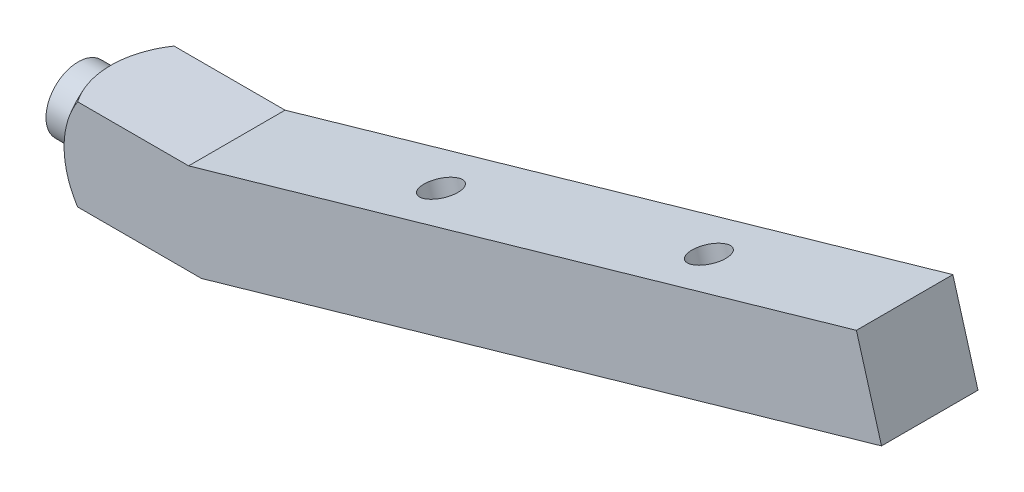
ISO-10303-21;
HEADER;
FILE_DESCRIPTION(('STEP AP214'),'2;1');
FILE_NAME('part.step','',(''),(''),'','','');
FILE_SCHEMA(('AUTOMOTIVE_DESIGN { 1 0 10303 214 1 1 1 1 }'));
ENDSEC;
DATA;
#1=APPLICATION_CONTEXT('core data for automotive mechanical design processes');
#2=APPLICATION_PROTOCOL_DEFINITION('international standard','automotive_design',2000,#1);
#3=PRODUCT_CONTEXT('',#1,'mechanical');
#4=PRODUCT('Part','Part','',(#3));
#5=PRODUCT_RELATED_PRODUCT_CATEGORY('part','',(#4));
#6=PRODUCT_DEFINITION_FORMATION('','',#4);
#7=PRODUCT_DEFINITION_CONTEXT('part definition',#1,'design');
#8=PRODUCT_DEFINITION('design','',#6,#7);
#9=PRODUCT_DEFINITION_SHAPE('','',#8);
#10=(LENGTH_UNIT() NAMED_UNIT(*) SI_UNIT(.MILLI.,.METRE.));
#11=(NAMED_UNIT(*) PLANE_ANGLE_UNIT() SI_UNIT($,.RADIAN.));
#12=(NAMED_UNIT(*) SI_UNIT($,.STERADIAN.) SOLID_ANGLE_UNIT());
#13=UNCERTAINTY_MEASURE_WITH_UNIT(LENGTH_MEASURE(1.E-05),#10,'distance_accuracy_value','');
#14=(GEOMETRIC_REPRESENTATION_CONTEXT(3) GLOBAL_UNCERTAINTY_ASSIGNED_CONTEXT((#13)) GLOBAL_UNIT_ASSIGNED_CONTEXT((#10,
#11,#12)) REPRESENTATION_CONTEXT('',''));
#15=CARTESIAN_POINT('',(0.,0.,0.));
#16=DIRECTION('',(0.,0.,1.));
#17=DIRECTION('',(1.,0.,0.));
#18=AXIS2_PLACEMENT_3D('',#15,#16,#17);
#19=CARTESIAN_POINT('',(0.,0.,18.));
#20=DIRECTION('',(0.,1.,0.));
#21=DIRECTION('',(0.,0.,1.));
#22=AXIS2_PLACEMENT_3D('',#19,#20,#21);
#23=PLANE('',#22);
#24=CARTESIAN_POINT('',(17.9705627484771,0.,9.));
#25=DIRECTION('',(0.,1.,0.));
#26=DIRECTION('',(0.,0.,1.));
#27=AXIS2_PLACEMENT_3D('',#24,#25,#26);
#28=CIRCLE('',#27,15.8666316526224);
#29=CARTESIAN_POINT('',(4.90342840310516,0.,0.));
#30=VERTEX_POINT('',#29);
#31=CARTESIAN_POINT('',(4.90342840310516,0.,18.));
#32=VERTEX_POINT('',#31);
#33=EDGE_CURVE('E121',#30,#32,#28,.T.);
#34=ORIENTED_EDGE('',*,*,#33,.F.);
#35=DIRECTION('',(1.,0.,0.));
#36=VECTOR('',#35,1.);
#37=CARTESIAN_POINT('',(0.,0.,0.));
#38=LINE('',#37,#36);
#39=CARTESIAN_POINT('',(28.,0.,0.));
#40=VERTEX_POINT('',#39);
#41=EDGE_CURVE('E125',#30,#40,#38,.T.);
#42=ORIENTED_EDGE('',*,*,#41,.T.);
#43=DIRECTION('',(0.,0.,-1.));
#44=VECTOR('',#43,1.);
#45=CARTESIAN_POINT('',(28.,0.,18.));
#46=LINE('',#45,#44);
#47=CARTESIAN_POINT('',(28.,0.,18.));
#48=VERTEX_POINT('',#47);
#49=EDGE_CURVE('E39',#48,#40,#46,.T.);
#50=ORIENTED_EDGE('',*,*,#49,.F.);
#51=DIRECTION('',(1.,0.,0.));
#52=VECTOR('',#51,1.);
#53=CARTESIAN_POINT('',(0.,0.,18.));
#54=LINE('',#53,#52);
#55=EDGE_CURVE('E82',#32,#48,#54,.T.);
#56=ORIENTED_EDGE('',*,*,#55,.F.);
#57=EDGE_LOOP('',(#34,#42,#50,#56));
#58=FACE_BOUND('',#57,.T.);
#59=ADVANCED_FACE('F32',(#58),#23,.F.);
#60=CARTESIAN_POINT('',(25.6108058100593,17.,18.));
#61=DIRECTION('',(0.,-1.,0.));
#62=DIRECTION('',(1.,0.,0.));
#63=AXIS2_PLACEMENT_3D('',#60,#61,#62);
#64=PLANE('',#63);
#65=CARTESIAN_POINT('',(17.9705627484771,17.,9.));
#66=DIRECTION('',(0.,-1.,0.));
#67=DIRECTION('',(1.,0.,0.));
#68=AXIS2_PLACEMENT_3D('',#65,#66,#67);
#69=CIRCLE('',#68,15.8666316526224);
#70=CARTESIAN_POINT('',(4.90342840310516,17.,18.));
#71=VERTEX_POINT('',#70);
#72=CARTESIAN_POINT('',(4.90342840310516,17.,0.));
#73=VERTEX_POINT('',#72);
#74=EDGE_CURVE('E45',#71,#73,#69,.T.);
#75=ORIENTED_EDGE('',*,*,#74,.F.);
#76=DIRECTION('',(-1.,0.,0.));
#77=VECTOR('',#76,1.);
#78=CARTESIAN_POINT('',(25.6108058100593,17.,18.));
#79=LINE('',#78,#77);
#80=CARTESIAN_POINT('',(25.6108058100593,17.,18.));
#81=VERTEX_POINT('',#80);
#82=EDGE_CURVE('E133',#81,#71,#79,.T.);
#83=ORIENTED_EDGE('',*,*,#82,.F.);
#84=DIRECTION('',(0.,0.,-1.));
#85=VECTOR('',#84,1.);
#86=CARTESIAN_POINT('',(25.6108058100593,17.,18.));
#87=LINE('',#86,#85);
#88=CARTESIAN_POINT('',(25.6108058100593,17.,0.));
#89=VERTEX_POINT('',#88);
#90=EDGE_CURVE('E135',#81,#89,#87,.T.);
#91=ORIENTED_EDGE('',*,*,#90,.T.);
#92=DIRECTION('',(-1.,0.,0.));
#93=VECTOR('',#92,1.);
#94=CARTESIAN_POINT('',(25.6108058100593,17.,0.));
#95=LINE('',#94,#93);
#96=EDGE_CURVE('E128',#89,#73,#95,.T.);
#97=ORIENTED_EDGE('',*,*,#96,.T.);
#98=EDGE_LOOP('',(#75,#83,#91,#97));
#99=FACE_BOUND('',#98,.T.);
#100=ADVANCED_FACE('F168',(#99),#64,.F.);
#101=CARTESIAN_POINT('',(0.,0.,18.));
#102=DIRECTION('',(0.,0.,1.));
#103=DIRECTION('',(1.,0.,0.));
#104=AXIS2_PLACEMENT_3D('',#101,#102,#103);
#105=PLANE('',#104);
#106=ORIENTED_EDGE('',*,*,#82,.T.);
#107=CARTESIAN_POINT('',(17.9705627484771,8.5,18.));
#108=DIRECTION('',(0.,0.,1.));
#109=DIRECTION('',(1.,0.,0.));
#110=AXIS2_PLACEMENT_3D('',#107,#108,#109);
#111=CIRCLE('',#110,15.5884572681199);
#112=EDGE_CURVE('E123',#71,#32,#111,.T.);
#113=ORIENTED_EDGE('',*,*,#112,.T.);
#114=ORIENTED_EDGE('',*,*,#55,.T.);
#115=DIRECTION('',(0.961261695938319,0.275637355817,0.));
#116=VECTOR('',#115,1.);
#117=CARTESIAN_POINT('',(28.,0.,18.));
#118=LINE('',#117,#116);
#119=CARTESIAN_POINT('',(154.886543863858,36.384130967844,18.));
#120=VERTEX_POINT('',#119);
#121=EDGE_CURVE('E127',#48,#120,#118,.T.);
#122=ORIENTED_EDGE('',*,*,#121,.T.);
#123=DIRECTION('',(-0.275637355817,0.961261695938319,0.));
#124=VECTOR('',#123,1.);
#125=CARTESIAN_POINT('',(154.886543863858,36.384130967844,18.));
#126=LINE('',#125,#124);
#127=CARTESIAN_POINT('',(150.200708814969,52.7255797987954,18.));
#128=VERTEX_POINT('',#127);
#129=EDGE_CURVE('E130',#120,#128,#126,.T.);
#130=ORIENTED_EDGE('',*,*,#129,.T.);
#131=DIRECTION('',(-0.961261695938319,-0.275637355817,0.));
#132=VECTOR('',#131,1.);
#133=CARTESIAN_POINT('',(150.200708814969,52.7255797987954,18.));
#134=LINE('',#133,#132);
#135=EDGE_CURVE('E54',#128,#81,#134,.T.);
#136=ORIENTED_EDGE('',*,*,#135,.T.);
#137=EDGE_LOOP('',(#106,#113,#114,#122,#130,#136));
#138=FACE_BOUND('',#137,.T.);
#139=ADVANCED_FACE('F169',(#138),#105,.T.);
#140=CARTESIAN_POINT('',(0.,0.,0.));
#141=DIRECTION('',(0.,0.,1.));
#142=DIRECTION('',(1.,0.,0.));
#143=AXIS2_PLACEMENT_3D('',#140,#141,#142);
#144=PLANE('',#143);
#145=CARTESIAN_POINT('',(17.9705627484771,8.5,0.));
#146=DIRECTION('',(0.,0.,1.));
#147=DIRECTION('',(1.,0.,0.));
#148=AXIS2_PLACEMENT_3D('',#145,#146,#147);
#149=CIRCLE('',#148,15.5884572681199);
#150=EDGE_CURVE('E11',#73,#30,#149,.T.);
#151=ORIENTED_EDGE('',*,*,#150,.F.);
#152=ORIENTED_EDGE('',*,*,#96,.F.);
#153=DIRECTION('',(-0.961261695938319,-0.275637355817,0.));
#154=VECTOR('',#153,1.);
#155=CARTESIAN_POINT('',(150.200708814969,52.7255797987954,0.));
#156=LINE('',#155,#154);
#157=CARTESIAN_POINT('',(150.200708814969,52.7255797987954,0.));
#158=VERTEX_POINT('',#157);
#159=EDGE_CURVE('E75',#158,#89,#156,.T.);
#160=ORIENTED_EDGE('',*,*,#159,.F.);
#161=DIRECTION('',(-0.275637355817,0.961261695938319,0.));
#162=VECTOR('',#161,1.);
#163=CARTESIAN_POINT('',(154.886543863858,36.384130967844,0.));
#164=LINE('',#163,#162);
#165=CARTESIAN_POINT('',(154.886543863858,36.384130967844,0.));
#166=VERTEX_POINT('',#165);
#167=EDGE_CURVE('E139',#166,#158,#164,.T.);
#168=ORIENTED_EDGE('',*,*,#167,.F.);
#169=DIRECTION('',(0.961261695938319,0.275637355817,0.));
#170=VECTOR('',#169,1.);
#171=CARTESIAN_POINT('',(28.,0.,0.));
#172=LINE('',#171,#170);
#173=EDGE_CURVE('E137',#40,#166,#172,.T.);
#174=ORIENTED_EDGE('',*,*,#173,.F.);
#175=ORIENTED_EDGE('',*,*,#41,.F.);
#176=EDGE_LOOP('',(#151,#152,#160,#168,#174,#175));
#177=FACE_BOUND('',#176,.T.);
#178=ADVANCED_FACE('F159',(#177),#144,.F.);
#179=CARTESIAN_POINT('',(28.,0.,18.));
#180=DIRECTION('',(-0.275637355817,0.961261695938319,0.));
#181=DIRECTION('',(-0.961261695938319,-0.275637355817,0.));
#182=AXIS2_PLACEMENT_3D('',#179,#180,#181);
#183=PLANE('',#182);
#184=CARTESIAN_POINT('',(68.3729912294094,11.576768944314,9.));
#185=DIRECTION('',(-0.275637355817,0.961261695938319,0.));
#186=DIRECTION('',(-0.961261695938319,-0.275637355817,0.));
#187=AXIS2_PLACEMENT_3D('',#184,#185,#186);
#188=CIRCLE('',#187,3.29999999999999);
#189=CARTESIAN_POINT('',(65.200827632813,10.6671656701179,9.));
#190=VERTEX_POINT('',#189);
#191=EDGE_CURVE('E211',#190,#190,#188,.T.);
#192=ORIENTED_EDGE('',*,*,#191,.T.);
#193=EDGE_LOOP('',(#192));
#194=FACE_BOUND('',#193,.T.);
#195=CARTESIAN_POINT('',(118.358599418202,25.909911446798,9.));
#196=DIRECTION('',(-0.275637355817,0.961261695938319,0.));
#197=DIRECTION('',(-0.961261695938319,-0.275637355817,0.));
#198=AXIS2_PLACEMENT_3D('',#195,#196,#197);
#199=CIRCLE('',#198,3.29999999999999);
#200=CARTESIAN_POINT('',(115.186435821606,25.0003081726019,9.));
#201=VERTEX_POINT('',#200);
#202=EDGE_CURVE('E105',#201,#201,#199,.T.);
#203=ORIENTED_EDGE('',*,*,#202,.T.);
#204=EDGE_LOOP('',(#203));
#205=FACE_BOUND('',#204,.T.);
#206=ORIENTED_EDGE('',*,*,#173,.T.);
#207=DIRECTION('',(0.,0.,-1.));
#208=VECTOR('',#207,1.);
#209=CARTESIAN_POINT('',(154.886543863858,36.384130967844,18.));
#210=LINE('',#209,#208);
#211=EDGE_CURVE('E147',#120,#166,#210,.T.);
#212=ORIENTED_EDGE('',*,*,#211,.F.);
#213=ORIENTED_EDGE('',*,*,#121,.F.);
#214=ORIENTED_EDGE('',*,*,#49,.T.);
#215=EDGE_LOOP('',(#206,#212,#213,#214));
#216=FACE_BOUND('',#215,.T.);
#217=ADVANCED_FACE('F153',(#194,#205,#216),#183,.F.);
#218=CARTESIAN_POINT('',(154.886543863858,36.384130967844,18.));
#219=DIRECTION('',(-0.961261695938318,-0.275637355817,0.));
#220=DIRECTION('',(0.275637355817,-0.961261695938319,0.));
#221=AXIS2_PLACEMENT_3D('',#218,#219,#220);
#222=PLANE('',#221);
#223=ORIENTED_EDGE('',*,*,#167,.T.);
#224=DIRECTION('',(0.,0.,-1.));
#225=VECTOR('',#224,1.);
#226=CARTESIAN_POINT('',(150.200708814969,52.7255797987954,18.));
#227=LINE('',#226,#225);
#228=EDGE_CURVE('E145',#128,#158,#227,.T.);
#229=ORIENTED_EDGE('',*,*,#228,.F.);
#230=ORIENTED_EDGE('',*,*,#129,.F.);
#231=ORIENTED_EDGE('',*,*,#211,.T.);
#232=EDGE_LOOP('',(#223,#229,#230,#231));
#233=FACE_BOUND('',#232,.T.);
#234=ADVANCED_FACE('F163',(#233),#222,.F.);
#235=CARTESIAN_POINT('',(150.200708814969,52.7255797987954,18.));
#236=DIRECTION('',(0.275637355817,-0.961261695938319,0.));
#237=DIRECTION('',(0.961261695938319,0.275637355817,0.));
#238=AXIS2_PLACEMENT_3D('',#235,#236,#237);
#239=PLANE('',#238);
#240=CARTESIAN_POINT('',(63.6871561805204,27.9182177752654,9.));
#241=DIRECTION('',(-0.275637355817,0.961261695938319,0.));
#242=DIRECTION('',(-0.961261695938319,-0.275637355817,0.));
#243=AXIS2_PLACEMENT_3D('',#240,#241,#242);
#244=CIRCLE('',#243,3.29999999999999);
#245=CARTESIAN_POINT('',(60.514992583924,27.0086145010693,9.));
#246=VERTEX_POINT('',#245);
#247=EDGE_CURVE('E307',#246,#246,#244,.T.);
#248=ORIENTED_EDGE('',*,*,#247,.F.);
#249=EDGE_LOOP('',(#248));
#250=FACE_BOUND('',#249,.T.);
#251=CARTESIAN_POINT('',(113.672764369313,42.2513602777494,9.));
#252=DIRECTION('',(-0.275637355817,0.961261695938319,0.));
#253=DIRECTION('',(-0.961261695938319,-0.275637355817,0.));
#254=AXIS2_PLACEMENT_3D('',#251,#252,#253);
#255=CIRCLE('',#254,3.29999999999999);
#256=CARTESIAN_POINT('',(110.500600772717,41.3417570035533,9.));
#257=VERTEX_POINT('',#256);
#258=EDGE_CURVE('E111',#257,#257,#255,.T.);
#259=ORIENTED_EDGE('',*,*,#258,.F.);
#260=EDGE_LOOP('',(#259));
#261=FACE_BOUND('',#260,.T.);
#262=ORIENTED_EDGE('',*,*,#159,.T.);
#263=ORIENTED_EDGE('',*,*,#90,.F.);
#264=ORIENTED_EDGE('',*,*,#135,.F.);
#265=ORIENTED_EDGE('',*,*,#228,.T.);
#266=EDGE_LOOP('',(#262,#263,#264,#265));
#267=FACE_BOUND('',#266,.T.);
#268=ADVANCED_FACE('F165',(#250,#261,#267),#239,.F.);
#269=CARTESIAN_POINT('',(17.9705627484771,8.5,9.));
#270=DIRECTION('',(-1.,0.,0.));
#271=DIRECTION('',(0.,1.,0.));
#272=AXIS2_PLACEMENT_3D('',#269,#270,#271);
#273=SPHERICAL_SURFACE('',#272,18.);
#274=ORIENTED_EDGE('',*,*,#74,.T.);
#275=ORIENTED_EDGE('',*,*,#150,.T.);
#276=ORIENTED_EDGE('',*,*,#33,.T.);
#277=ORIENTED_EDGE('',*,*,#112,.F.);
#278=EDGE_LOOP('',(#274,#275,#276,#277));
#279=FACE_BOUND('',#278,.T.);
#280=CARTESIAN_POINT('',(1.,8.5,9.));
#281=DIRECTION('',(-1.,0.,0.));
#282=DIRECTION('',(0.,0.,1.));
#283=AXIS2_PLACEMENT_3D('',#280,#281,#282);
#284=CIRCLE('',#283,6.);
#285=CARTESIAN_POINT('',(1.,8.5,15.));
#286=VERTEX_POINT('',#285);
#287=EDGE_CURVE('E117',#286,#286,#284,.T.);
#288=ORIENTED_EDGE('',*,*,#287,.F.);
#289=EDGE_LOOP('',(#288));
#290=FACE_BOUND('',#289,.T.);
#291=ADVANCED_FACE('F171',(#279,#290),#273,.T.);
#292=CARTESIAN_POINT('',(-4.,8.5,9.));
#293=DIRECTION('',(1.,0.,0.));
#294=DIRECTION('',(0.,0.,-1.));
#295=AXIS2_PLACEMENT_3D('',#292,#293,#294);
#296=CYLINDRICAL_SURFACE('',#295,6.);
#297=CARTESIAN_POINT('',(-4.,8.5,9.));
#298=DIRECTION('',(-1.,0.,0.));
#299=DIRECTION('',(0.,0.,1.));
#300=AXIS2_PLACEMENT_3D('',#297,#298,#299);
#301=CIRCLE('',#300,6.);
#302=CARTESIAN_POINT('',(-4.,8.5,15.));
#303=VERTEX_POINT('',#302);
#304=EDGE_CURVE('E108',#303,#303,#301,.T.);
#305=ORIENTED_EDGE('',*,*,#304,.F.);
#306=EDGE_LOOP('',(#305));
#307=FACE_BOUND('',#306,.T.);
#308=ORIENTED_EDGE('',*,*,#287,.T.);
#309=EDGE_LOOP('',(#308));
#310=FACE_BOUND('',#309,.T.);
#311=ADVANCED_FACE('F174',(#307,#310),#296,.T.);
#312=CARTESIAN_POINT('',(-4.,8.5,9.));
#313=DIRECTION('',(-1.,0.,0.));
#314=DIRECTION('',(0.,0.,1.));
#315=AXIS2_PLACEMENT_3D('',#312,#313,#314);
#316=PLANE('',#315);
#317=CARTESIAN_POINT('',(-4.,8.5,9.));
#318=DIRECTION('',(-1.,0.,0.));
#319=DIRECTION('',(0.,0.,1.));
#320=AXIS2_PLACEMENT_3D('',#317,#318,#319);
#321=CIRCLE('',#320,3.4);
#322=CARTESIAN_POINT('',(-4.,8.5,12.4));
#323=VERTEX_POINT('',#322);
#324=EDGE_CURVE('E104',#323,#323,#321,.T.);
#325=ORIENTED_EDGE('',*,*,#324,.F.);
#326=EDGE_LOOP('',(#325));
#327=FACE_BOUND('',#326,.T.);
#328=ORIENTED_EDGE('',*,*,#304,.T.);
#329=EDGE_LOOP('',(#328));
#330=FACE_BOUND('',#329,.T.);
#331=ADVANCED_FACE('F179',(#327,#330),#316,.T.);
#332=CARTESIAN_POINT('',(-4.,8.5,9.));
#333=DIRECTION('',(-1.,0.,0.));
#334=DIRECTION('',(0.,0.,1.));
#335=AXIS2_PLACEMENT_3D('',#332,#333,#334);
#336=CYLINDRICAL_SURFACE('',#335,3.4);
#337=CARTESIAN_POINT('',(24.,8.5,9.));
#338=DIRECTION('',(-1.,0.,0.));
#339=DIRECTION('',(0.,0.,1.));
#340=AXIS2_PLACEMENT_3D('',#337,#338,#339);
#341=CIRCLE('',#340,3.39999999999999);
#342=CARTESIAN_POINT('',(24.,8.5,12.4));
#343=VERTEX_POINT('',#342);
#344=EDGE_CURVE('E102',#343,#343,#341,.T.);
#345=ORIENTED_EDGE('',*,*,#344,.F.);
#346=EDGE_LOOP('',(#345));
#347=FACE_BOUND('',#346,.T.);
#348=ORIENTED_EDGE('',*,*,#324,.T.);
#349=EDGE_LOOP('',(#348));
#350=FACE_BOUND('',#349,.T.);
#351=ADVANCED_FACE('F98',(#347,#350),#336,.F.);
#352=CARTESIAN_POINT('',(24.,8.5,9.));
#353=DIRECTION('',(-1.,0.,0.));
#354=DIRECTION('',(0.,0.,1.));
#355=AXIS2_PLACEMENT_3D('',#352,#353,#354);
#356=CONICAL_SURFACE('',#355,3.39999999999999,1.02974425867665);
#357=CARTESIAN_POINT('',(26.0429261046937,8.49999999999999,9.));
#358=VERTEX_POINT('',#357);
#359=VERTEX_LOOP('',#358);
#360=FACE_BOUND('',#359,.T.);
#361=ORIENTED_EDGE('',*,*,#344,.T.);
#362=EDGE_LOOP('',(#361));
#363=FACE_BOUND('',#362,.T.);
#364=ADVANCED_FACE('F94',(#360,#363),#356,.F.);
#365=CARTESIAN_POINT('',(113.672764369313,42.2513602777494,9.));
#366=DIRECTION('',(-0.275637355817,0.961261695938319,0.));
#367=DIRECTION('',(-0.961261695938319,-0.275637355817,0.));
#368=AXIS2_PLACEMENT_3D('',#365,#366,#367);
#369=CYLINDRICAL_SURFACE('',#368,3.29999999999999);
#370=ORIENTED_EDGE('',*,*,#258,.T.);
#371=EDGE_LOOP('',(#370));
#372=FACE_BOUND('',#371,.T.);
#373=ORIENTED_EDGE('',*,*,#202,.F.);
#374=EDGE_LOOP('',(#373));
#375=FACE_BOUND('',#374,.T.);
#376=ADVANCED_FACE('F97',(#372,#375),#369,.F.);
#377=CARTESIAN_POINT('',(63.6871561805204,27.9182177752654,9.));
#378=DIRECTION('',(-0.275637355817,0.961261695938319,0.));
#379=DIRECTION('',(-0.961261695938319,-0.275637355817,0.));
#380=AXIS2_PLACEMENT_3D('',#377,#378,#379);
#381=CYLINDRICAL_SURFACE('',#380,3.29999999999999);
#382=ORIENTED_EDGE('',*,*,#247,.T.);
#383=EDGE_LOOP('',(#382));
#384=FACE_BOUND('',#383,.T.);
#385=ORIENTED_EDGE('',*,*,#191,.F.);
#386=EDGE_LOOP('',(#385));
#387=FACE_BOUND('',#386,.T.);
#388=ADVANCED_FACE('F215',(#384,#387),#381,.F.);
#389=CLOSED_SHELL('',(#59,#100,#139,#178,#217,#234,#268,#291,#311,#331,#351,#364,#376,#388));
#390=MANIFOLD_SOLID_BREP('B2',#389);
#391=ADVANCED_BREP_SHAPE_REPRESENTATION('',(#18,#390),#14);
#392=SHAPE_DEFINITION_REPRESENTATION(#9,#391);
ENDSEC;
END-ISO-10303-21;
